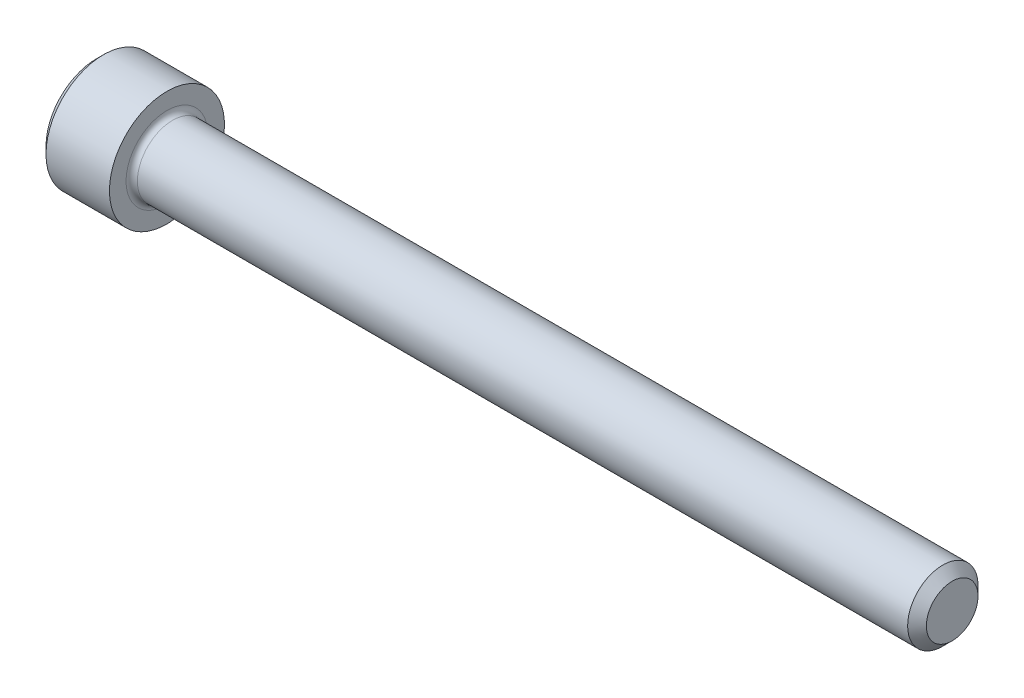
ISO-10303-21;
HEADER;
FILE_DESCRIPTION(('STEP AP214'),'2;1');
FILE_NAME('part.step','',(''),(''),'','','');
FILE_SCHEMA(('AUTOMOTIVE_DESIGN { 1 0 10303 214 1 1 1 1 }'));
ENDSEC;
DATA;
#1=APPLICATION_CONTEXT('core data for automotive mechanical design processes');
#2=APPLICATION_PROTOCOL_DEFINITION('international standard','automotive_design',2000,#1);
#3=PRODUCT_CONTEXT('',#1,'mechanical');
#4=PRODUCT('Part','Part','',(#3));
#5=PRODUCT_RELATED_PRODUCT_CATEGORY('part','',(#4));
#6=PRODUCT_DEFINITION_FORMATION('','',#4);
#7=PRODUCT_DEFINITION_CONTEXT('part definition',#1,'design');
#8=PRODUCT_DEFINITION('design','',#6,#7);
#9=PRODUCT_DEFINITION_SHAPE('','',#8);
#10=(LENGTH_UNIT() NAMED_UNIT(*) SI_UNIT(.MILLI.,.METRE.));
#11=(NAMED_UNIT(*) PLANE_ANGLE_UNIT() SI_UNIT($,.RADIAN.));
#12=(NAMED_UNIT(*) SI_UNIT($,.STERADIAN.) SOLID_ANGLE_UNIT());
#13=UNCERTAINTY_MEASURE_WITH_UNIT(LENGTH_MEASURE(1.E-05),#10,'distance_accuracy_value','');
#14=(GEOMETRIC_REPRESENTATION_CONTEXT(3) GLOBAL_UNCERTAINTY_ASSIGNED_CONTEXT((#13)) GLOBAL_UNIT_ASSIGNED_CONTEXT((#10,
#11,#12)) REPRESENTATION_CONTEXT('',''));
#15=CARTESIAN_POINT('',(0.,0.,0.));
#16=DIRECTION('',(0.,0.,1.));
#17=DIRECTION('',(1.,0.,0.));
#18=AXIS2_PLACEMENT_3D('',#15,#16,#17);
#19=CARTESIAN_POINT('',(0.,0.,0.));
#20=DIRECTION('',(-1.,0.,0.));
#21=DIRECTION('',(0.,0.,1.));
#22=AXIS2_PLACEMENT_3D('',#19,#20,#21);
#23=PLANE('',#22);
#24=DIRECTION('',(0.,-0.499999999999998,0.86602540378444));
#25=VECTOR('',#24,1.);
#26=CARTESIAN_POINT('',(0.,1.37848150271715,0.));
#27=LINE('',#26,#25);
#28=CARTESIAN_POINT('',(0.,1.37848150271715,0.));
#29=VERTEX_POINT('',#28);
#30=CARTESIAN_POINT('',(0.,0.689240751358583,1.1938));
#31=VERTEX_POINT('',#30);
#32=EDGE_CURVE('E258',#29,#31,#27,.T.);
#33=ORIENTED_EDGE('',*,*,#32,.T.);
#34=DIRECTION('',(0.,1.,0.));
#35=VECTOR('',#34,1.);
#36=CARTESIAN_POINT('',(0.,-0.689240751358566,1.1938));
#37=LINE('',#36,#35);
#38=CARTESIAN_POINT('',(0.,-0.689240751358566,1.1938));
#39=VERTEX_POINT('',#38);
#40=EDGE_CURVE('E129',#39,#31,#37,.T.);
#41=ORIENTED_EDGE('',*,*,#40,.F.);
#42=DIRECTION('',(0.,-0.500000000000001,-0.866025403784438));
#43=VECTOR('',#42,1.);
#44=CARTESIAN_POINT('',(0.,-0.689240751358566,1.1938));
#45=LINE('',#44,#43);
#46=CARTESIAN_POINT('',(0.,-1.37848150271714,0.));
#47=VERTEX_POINT('',#46);
#48=EDGE_CURVE('E261',#39,#47,#45,.T.);
#49=ORIENTED_EDGE('',*,*,#48,.T.);
#50=DIRECTION('',(0.,0.499999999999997,-0.86602540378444));
#51=VECTOR('',#50,1.);
#52=CARTESIAN_POINT('',(0.,-1.37848150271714,0.));
#53=LINE('',#52,#51);
#54=CARTESIAN_POINT('',(0.,-0.689240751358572,-1.1938));
#55=VERTEX_POINT('',#54);
#56=EDGE_CURVE('E264',#47,#55,#53,.T.);
#57=ORIENTED_EDGE('',*,*,#56,.T.);
#58=DIRECTION('',(0.,-1.,0.));
#59=VECTOR('',#58,1.);
#60=CARTESIAN_POINT('',(0.,0.689240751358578,-1.1938));
#61=LINE('',#60,#59);
#62=CARTESIAN_POINT('',(0.,0.689240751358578,-1.1938));
#63=VERTEX_POINT('',#62);
#64=EDGE_CURVE('E267',#63,#55,#61,.T.);
#65=ORIENTED_EDGE('',*,*,#64,.F.);
#66=DIRECTION('',(0.,-0.500000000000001,-0.866025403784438));
#67=VECTOR('',#66,1.);
#68=CARTESIAN_POINT('',(0.,1.37848150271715,0.));
#69=LINE('',#68,#67);
#70=EDGE_CURVE('E124',#29,#63,#69,.T.);
#71=ORIENTED_EDGE('',*,*,#70,.F.);
#72=EDGE_LOOP('',(#33,#41,#49,#57,#65,#71));
#73=FACE_BOUND('',#72,.T.);
#74=CARTESIAN_POINT('',(0.,0.,0.));
#75=DIRECTION('',(-1.,0.,0.));
#76=DIRECTION('',(0.,0.,1.));
#77=AXIS2_PLACEMENT_3D('',#74,#75,#76);
#78=CIRCLE('',#77,2.0447);
#79=CARTESIAN_POINT('',(0.,0.,2.0447));
#80=VERTEX_POINT('',#79);
#81=EDGE_CURVE('E153',#80,#80,#78,.T.);
#82=ORIENTED_EDGE('',*,*,#81,.T.);
#83=EDGE_LOOP('',(#82));
#84=FACE_BOUND('',#83,.T.);
#85=ADVANCED_FACE('F33',(#73,#84),#23,.T.);
#86=CARTESIAN_POINT('',(0.,0.,0.));
#87=DIRECTION('',(1.,0.,0.));
#88=DIRECTION('',(0.,0.,-1.));
#89=AXIS2_PLACEMENT_3D('',#86,#87,#88);
#90=CONICAL_SURFACE('',#89,2.0447,0.785398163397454);
#91=CARTESIAN_POINT('',(0.279399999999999,0.,0.));
#92=DIRECTION('',(-1.,0.,0.));
#93=DIRECTION('',(0.,0.,1.));
#94=AXIS2_PLACEMENT_3D('',#91,#92,#93);
#95=CIRCLE('',#94,2.3241);
#96=CARTESIAN_POINT('',(0.279399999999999,0.,2.3241));
#97=VERTEX_POINT('',#96);
#98=EDGE_CURVE('E150',#97,#97,#95,.T.);
#99=ORIENTED_EDGE('',*,*,#98,.T.);
#100=EDGE_LOOP('',(#99));
#101=FACE_BOUND('',#100,.T.);
#102=ORIENTED_EDGE('',*,*,#81,.F.);
#103=EDGE_LOOP('',(#102));
#104=FACE_BOUND('',#103,.T.);
#105=ADVANCED_FACE('F174',(#101,#104),#90,.T.);
#106=CARTESIAN_POINT('',(-31.75,0.,0.));
#107=DIRECTION('',(-1.,0.,0.));
#108=DIRECTION('',(0.,0.,1.));
#109=AXIS2_PLACEMENT_3D('',#106,#107,#108);
#110=CYLINDRICAL_SURFACE('',#109,2.3241);
#111=CARTESIAN_POINT('',(2.8448,0.,0.));
#112=DIRECTION('',(-1.,0.,0.));
#113=DIRECTION('',(0.,0.,1.));
#114=AXIS2_PLACEMENT_3D('',#111,#112,#113);
#115=CIRCLE('',#114,2.3241);
#116=CARTESIAN_POINT('',(2.8448,0.,2.3241));
#117=VERTEX_POINT('',#116);
#118=EDGE_CURVE('E147',#117,#117,#115,.T.);
#119=ORIENTED_EDGE('',*,*,#118,.T.);
#120=EDGE_LOOP('',(#119));
#121=FACE_BOUND('',#120,.T.);
#122=ORIENTED_EDGE('',*,*,#98,.F.);
#123=EDGE_LOOP('',(#122));
#124=FACE_BOUND('',#123,.T.);
#125=ADVANCED_FACE('F179',(#121,#124),#110,.T.);
#126=CARTESIAN_POINT('',(2.8448,2.3241,0.));
#127=DIRECTION('',(1.,0.,0.));
#128=DIRECTION('',(0.,0.,-1.));
#129=AXIS2_PLACEMENT_3D('',#126,#127,#128);
#130=PLANE('',#129);
#131=CARTESIAN_POINT('',(2.8448,0.,0.));
#132=DIRECTION('',(1.,0.,0.));
#133=DIRECTION('',(0.,0.,-1.));
#134=AXIS2_PLACEMENT_3D('',#131,#132,#133);
#135=CIRCLE('',#134,1.65099999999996);
#136=CARTESIAN_POINT('',(2.8448,0.,-1.65099999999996));
#137=VERTEX_POINT('',#136);
#138=EDGE_CURVE('E41',#137,#137,#135,.F.);
#139=ORIENTED_EDGE('',*,*,#138,.T.);
#140=EDGE_LOOP('',(#139));
#141=FACE_BOUND('',#140,.T.);
#142=ORIENTED_EDGE('',*,*,#118,.F.);
#143=EDGE_LOOP('',(#142));
#144=FACE_BOUND('',#143,.T.);
#145=ADVANCED_FACE('F158',(#141,#144),#130,.T.);
#146=CARTESIAN_POINT('',(-31.75,0.,0.));
#147=DIRECTION('',(-1.,0.,0.));
#148=DIRECTION('',(0.,0.,1.));
#149=AXIS2_PLACEMENT_3D('',#146,#147,#148);
#150=CYLINDRICAL_SURFACE('',#149,1.42239999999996);
#151=CARTESIAN_POINT('',(3.0734,0.,0.));
#152=DIRECTION('',(1.,0.,0.));
#153=DIRECTION('',(0.,0.,-1.));
#154=AXIS2_PLACEMENT_3D('',#151,#152,#153);
#155=CIRCLE('',#154,1.42239999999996);
#156=CARTESIAN_POINT('',(3.0734,0.,-1.42239999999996));
#157=VERTEX_POINT('',#156);
#158=EDGE_CURVE('E11',#157,#157,#155,.T.);
#159=ORIENTED_EDGE('',*,*,#158,.T.);
#160=EDGE_LOOP('',(#159));
#161=FACE_BOUND('',#160,.T.);
#162=CARTESIAN_POINT('',(34.2163399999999,0.,0.));
#163=DIRECTION('',(-1.,0.,0.));
#164=DIRECTION('',(0.,0.,1.));
#165=AXIS2_PLACEMENT_3D('',#162,#163,#164);
#166=CIRCLE('',#165,1.42239999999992);
#167=CARTESIAN_POINT('',(34.2163399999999,0.,1.42239999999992));
#168=VERTEX_POINT('',#167);
#169=EDGE_CURVE('E144',#168,#168,#166,.T.);
#170=ORIENTED_EDGE('',*,*,#169,.T.);
#171=EDGE_LOOP('',(#170));
#172=FACE_BOUND('',#171,.T.);
#173=ADVANCED_FACE('F189',(#161,#172),#150,.T.);
#174=CARTESIAN_POINT('',(34.5948,0.,0.));
#175=DIRECTION('',(-1.,0.,0.));
#176=DIRECTION('',(0.,0.,1.));
#177=AXIS2_PLACEMENT_3D('',#174,#175,#176);
#178=CONICAL_SURFACE('',#177,1.04394,0.785398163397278);
#179=ORIENTED_EDGE('',*,*,#169,.F.);
#180=EDGE_LOOP('',(#179));
#181=FACE_BOUND('',#180,.T.);
#182=CARTESIAN_POINT('',(34.5948,0.,0.));
#183=DIRECTION('',(-1.,0.,0.));
#184=DIRECTION('',(0.,0.,1.));
#185=AXIS2_PLACEMENT_3D('',#182,#183,#184);
#186=CIRCLE('',#185,1.04394);
#187=CARTESIAN_POINT('',(34.5948,0.,1.04394));
#188=VERTEX_POINT('',#187);
#189=EDGE_CURVE('E140',#188,#188,#186,.T.);
#190=ORIENTED_EDGE('',*,*,#189,.T.);
#191=EDGE_LOOP('',(#190));
#192=FACE_BOUND('',#191,.T.);
#193=ADVANCED_FACE('F169',(#181,#192),#178,.T.);
#194=CARTESIAN_POINT('',(34.5948,1.04394,0.));
#195=DIRECTION('',(1.,0.,0.));
#196=DIRECTION('',(0.,0.,-1.));
#197=AXIS2_PLACEMENT_3D('',#194,#195,#196);
#198=PLANE('',#197);
#199=ORIENTED_EDGE('',*,*,#189,.F.);
#200=EDGE_LOOP('',(#199));
#201=FACE_BOUND('',#200,.T.);
#202=ADVANCED_FACE('F162',(#201),#198,.T.);
#203=CARTESIAN_POINT('',(3.0734,0.,0.));
#204=DIRECTION('',(1.,0.,0.));
#205=DIRECTION('',(0.,0.,-1.));
#206=AXIS2_PLACEMENT_3D('',#203,#204,#205);
#207=TOROIDAL_SURFACE('',#206,1.65099999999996,0.2286);
#208=ORIENTED_EDGE('',*,*,#158,.F.);
#209=EDGE_LOOP('',(#208));
#210=FACE_BOUND('',#209,.T.);
#211=ORIENTED_EDGE('',*,*,#138,.F.);
#212=EDGE_LOOP('',(#211));
#213=FACE_BOUND('',#212,.T.);
#214=ADVANCED_FACE('F35',(#210,#213),#207,.F.);
#215=CARTESIAN_POINT('',(1.2954,1.37848150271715,0.));
#216=DIRECTION('',(0.,-0.86602540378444,-0.499999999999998));
#217=DIRECTION('',(0.,0.499999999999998,-0.86602540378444));
#218=AXIS2_PLACEMENT_3D('',#215,#216,#217);
#219=PLANE('',#218);
#220=ORIENTED_EDGE('',*,*,#32,.F.);
#221=DIRECTION('',(-1.,0.,0.));
#222=VECTOR('',#221,1.);
#223=CARTESIAN_POINT('',(1.2954,1.37848150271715,0.));
#224=LINE('',#223,#222);
#225=CARTESIAN_POINT('',(1.2954,1.37848150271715,0.));
#226=VERTEX_POINT('',#225);
#227=EDGE_CURVE('E248',#226,#29,#224,.T.);
#228=ORIENTED_EDGE('',*,*,#227,.F.);
#229=DIRECTION('',(0.,-0.499999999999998,0.86602540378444));
#230=VECTOR('',#229,1.);
#231=CARTESIAN_POINT('',(1.2954,1.37848150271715,0.));
#232=LINE('',#231,#230);
#233=CARTESIAN_POINT('',(1.2954,1.03386112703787,0.596899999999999));
#234=VERTEX_POINT('',#233);
#235=EDGE_CURVE('E116',#226,#234,#232,.T.);
#236=ORIENTED_EDGE('',*,*,#235,.T.);
#237=CARTESIAN_POINT('',(1.2954,0.689240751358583,1.1938));
#238=VERTEX_POINT('',#237);
#239=EDGE_CURVE('E107',#234,#238,#232,.T.);
#240=ORIENTED_EDGE('',*,*,#239,.T.);
#241=DIRECTION('',(-1.,0.,0.));
#242=VECTOR('',#241,1.);
#243=CARTESIAN_POINT('',(1.2954,0.689240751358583,1.1938));
#244=LINE('',#243,#242);
#245=EDGE_CURVE('E121',#238,#31,#244,.T.);
#246=ORIENTED_EDGE('',*,*,#245,.T.);
#247=EDGE_LOOP('',(#220,#228,#236,#240,#246));
#248=FACE_BOUND('',#247,.T.);
#249=ADVANCED_FACE('F120',(#248),#219,.T.);
#250=CARTESIAN_POINT('',(1.2954,-0.689240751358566,1.1938));
#251=DIRECTION('',(0.,0.,1.));
#252=DIRECTION('',(0.,-1.,0.));
#253=AXIS2_PLACEMENT_3D('',#250,#251,#252);
#254=PLANE('',#253);
#255=ORIENTED_EDGE('',*,*,#40,.T.);
#256=ORIENTED_EDGE('',*,*,#245,.F.);
#257=DIRECTION('',(0.,1.,0.));
#258=VECTOR('',#257,1.);
#259=CARTESIAN_POINT('',(1.2954,-0.689240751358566,1.1938));
#260=LINE('',#259,#258);
#261=CARTESIAN_POINT('',(1.2954,0.,1.1938));
#262=VERTEX_POINT('',#261);
#263=EDGE_CURVE('E104',#262,#238,#260,.T.);
#264=ORIENTED_EDGE('',*,*,#263,.F.);
#265=CARTESIAN_POINT('',(1.2954,-0.689240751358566,1.1938));
#266=VERTEX_POINT('',#265);
#267=EDGE_CURVE('E115',#266,#262,#260,.T.);
#268=ORIENTED_EDGE('',*,*,#267,.F.);
#269=DIRECTION('',(-1.,0.,0.));
#270=VECTOR('',#269,1.);
#271=CARTESIAN_POINT('',(1.2954,-0.689240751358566,1.1938));
#272=LINE('',#271,#270);
#273=EDGE_CURVE('E131',#266,#39,#272,.T.);
#274=ORIENTED_EDGE('',*,*,#273,.T.);
#275=EDGE_LOOP('',(#255,#256,#264,#268,#274));
#276=FACE_BOUND('',#275,.T.);
#277=ADVANCED_FACE('F126',(#276),#254,.F.);
#278=CARTESIAN_POINT('',(1.2954,-0.689240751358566,1.1938));
#279=DIRECTION('',(0.,0.866025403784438,-0.500000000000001));
#280=DIRECTION('',(0.,0.500000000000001,0.866025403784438));
#281=AXIS2_PLACEMENT_3D('',#278,#279,#280);
#282=PLANE('',#281);
#283=ORIENTED_EDGE('',*,*,#48,.F.);
#284=ORIENTED_EDGE('',*,*,#273,.F.);
#285=DIRECTION('',(0.,-0.500000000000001,-0.866025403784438));
#286=VECTOR('',#285,1.);
#287=CARTESIAN_POINT('',(1.2954,-0.689240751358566,1.1938));
#288=LINE('',#287,#286);
#289=CARTESIAN_POINT('',(1.2954,-1.03386112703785,0.596899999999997));
#290=VERTEX_POINT('',#289);
#291=EDGE_CURVE('E287',#266,#290,#288,.T.);
#292=ORIENTED_EDGE('',*,*,#291,.T.);
#293=CARTESIAN_POINT('',(1.2954,-1.37848150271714,0.));
#294=VERTEX_POINT('',#293);
#295=EDGE_CURVE('E276',#290,#294,#288,.T.);
#296=ORIENTED_EDGE('',*,*,#295,.T.);
#297=DIRECTION('',(-1.,0.,0.));
#298=VECTOR('',#297,1.);
#299=CARTESIAN_POINT('',(1.2954,-1.37848150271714,0.));
#300=LINE('',#299,#298);
#301=EDGE_CURVE('E136',#294,#47,#300,.T.);
#302=ORIENTED_EDGE('',*,*,#301,.T.);
#303=EDGE_LOOP('',(#283,#284,#292,#296,#302));
#304=FACE_BOUND('',#303,.T.);
#305=ADVANCED_FACE('F202',(#304),#282,.T.);
#306=CARTESIAN_POINT('',(1.2954,-1.37848150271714,0.));
#307=DIRECTION('',(0.,0.86602540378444,0.499999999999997));
#308=DIRECTION('',(0.,-0.499999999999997,0.86602540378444));
#309=AXIS2_PLACEMENT_3D('',#306,#307,#308);
#310=PLANE('',#309);
#311=ORIENTED_EDGE('',*,*,#56,.F.);
#312=ORIENTED_EDGE('',*,*,#301,.F.);
#313=DIRECTION('',(0.,0.499999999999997,-0.86602540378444));
#314=VECTOR('',#313,1.);
#315=CARTESIAN_POINT('',(1.2954,-1.37848150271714,0.));
#316=LINE('',#315,#314);
#317=CARTESIAN_POINT('',(1.2954,-1.03386112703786,-0.596899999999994));
#318=VERTEX_POINT('',#317);
#319=EDGE_CURVE('E254',#294,#318,#316,.T.);
#320=ORIENTED_EDGE('',*,*,#319,.T.);
#321=CARTESIAN_POINT('',(1.2954,-0.689240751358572,-1.1938));
#322=VERTEX_POINT('',#321);
#323=EDGE_CURVE('E286',#318,#322,#316,.T.);
#324=ORIENTED_EDGE('',*,*,#323,.T.);
#325=DIRECTION('',(-1.,0.,0.));
#326=VECTOR('',#325,1.);
#327=CARTESIAN_POINT('',(1.2954,-0.689240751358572,-1.1938));
#328=LINE('',#327,#326);
#329=EDGE_CURVE('E247',#322,#55,#328,.T.);
#330=ORIENTED_EDGE('',*,*,#329,.T.);
#331=EDGE_LOOP('',(#311,#312,#320,#324,#330));
#332=FACE_BOUND('',#331,.T.);
#333=ADVANCED_FACE('F205',(#332),#310,.T.);
#334=CARTESIAN_POINT('',(1.2954,0.689240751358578,-1.1938));
#335=DIRECTION('',(0.,0.,-1.));
#336=DIRECTION('',(0.,1.,0.));
#337=AXIS2_PLACEMENT_3D('',#334,#335,#336);
#338=PLANE('',#337);
#339=ORIENTED_EDGE('',*,*,#64,.T.);
#340=ORIENTED_EDGE('',*,*,#329,.F.);
#341=DIRECTION('',(0.,-1.,0.));
#342=VECTOR('',#341,1.);
#343=CARTESIAN_POINT('',(1.2954,0.689240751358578,-1.1938));
#344=LINE('',#343,#342);
#345=CARTESIAN_POINT('',(1.2954,0.,-1.1938));
#346=VERTEX_POINT('',#345);
#347=EDGE_CURVE('E251',#346,#322,#344,.T.);
#348=ORIENTED_EDGE('',*,*,#347,.F.);
#349=CARTESIAN_POINT('',(1.2954,0.689240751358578,-1.1938));
#350=VERTEX_POINT('',#349);
#351=EDGE_CURVE('E48',#350,#346,#344,.T.);
#352=ORIENTED_EDGE('',*,*,#351,.F.);
#353=DIRECTION('',(-1.,0.,0.));
#354=VECTOR('',#353,1.);
#355=CARTESIAN_POINT('',(1.2954,0.689240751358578,-1.1938));
#356=LINE('',#355,#354);
#357=EDGE_CURVE('E244',#350,#63,#356,.T.);
#358=ORIENTED_EDGE('',*,*,#357,.T.);
#359=EDGE_LOOP('',(#339,#340,#348,#352,#358));
#360=FACE_BOUND('',#359,.T.);
#361=ADVANCED_FACE('F209',(#360),#338,.F.);
#362=CARTESIAN_POINT('',(1.2954,1.37848150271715,0.));
#363=DIRECTION('',(0.,0.866025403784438,-0.500000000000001));
#364=DIRECTION('',(0.,0.500000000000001,0.866025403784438));
#365=AXIS2_PLACEMENT_3D('',#362,#363,#364);
#366=PLANE('',#365);
#367=ORIENTED_EDGE('',*,*,#70,.T.);
#368=ORIENTED_EDGE('',*,*,#357,.F.);
#369=DIRECTION('',(0.,-0.500000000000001,-0.866025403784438));
#370=VECTOR('',#369,1.);
#371=CARTESIAN_POINT('',(1.2954,1.37848150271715,0.));
#372=LINE('',#371,#370);
#373=CARTESIAN_POINT('',(1.2954,1.03386112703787,-0.596900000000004));
#374=VERTEX_POINT('',#373);
#375=EDGE_CURVE('E234',#374,#350,#372,.T.);
#376=ORIENTED_EDGE('',*,*,#375,.F.);
#377=EDGE_CURVE('E240',#226,#374,#372,.T.);
#378=ORIENTED_EDGE('',*,*,#377,.F.);
#379=ORIENTED_EDGE('',*,*,#227,.T.);
#380=EDGE_LOOP('',(#367,#368,#376,#378,#379));
#381=FACE_BOUND('',#380,.T.);
#382=ADVANCED_FACE('F213',(#381),#366,.F.);
#383=CARTESIAN_POINT('',(1.2954,2.06772225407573,-1.1938));
#384=DIRECTION('',(1.,0.,0.));
#385=DIRECTION('',(0.,0.,-1.));
#386=AXIS2_PLACEMENT_3D('',#383,#384,#385);
#387=PLANE('',#386);
#388=ORIENTED_EDGE('',*,*,#347,.T.);
#389=ORIENTED_EDGE('',*,*,#323,.F.);
#390=CARTESIAN_POINT('',(1.2954,0.,0.));
#391=DIRECTION('',(-1.,0.,0.));
#392=DIRECTION('',(0.,0.,1.));
#393=AXIS2_PLACEMENT_3D('',#390,#391,#392);
#394=CIRCLE('',#393,1.1938);
#395=EDGE_CURVE('E282',#346,#318,#394,.T.);
#396=ORIENTED_EDGE('',*,*,#395,.F.);
#397=EDGE_LOOP('',(#388,#389,#396));
#398=FACE_BOUND('',#397,.T.);
#399=ADVANCED_FACE('F217',(#398),#387,.F.);
#400=ORIENTED_EDGE('',*,*,#319,.F.);
#401=ORIENTED_EDGE('',*,*,#295,.F.);
#402=EDGE_CURVE('E134',#318,#290,#394,.T.);
#403=ORIENTED_EDGE('',*,*,#402,.F.);
#404=EDGE_LOOP('',(#400,#401,#403));
#405=FACE_BOUND('',#404,.T.);
#406=ADVANCED_FACE('F220',(#405),#387,.F.);
#407=ORIENTED_EDGE('',*,*,#291,.F.);
#408=ORIENTED_EDGE('',*,*,#267,.T.);
#409=EDGE_CURVE('E130',#290,#262,#394,.T.);
#410=ORIENTED_EDGE('',*,*,#409,.F.);
#411=EDGE_LOOP('',(#407,#408,#410));
#412=FACE_BOUND('',#411,.T.);
#413=ADVANCED_FACE('F225',(#412),#387,.F.);
#414=ORIENTED_EDGE('',*,*,#263,.T.);
#415=ORIENTED_EDGE('',*,*,#239,.F.);
#416=EDGE_CURVE('E110',#262,#234,#394,.T.);
#417=ORIENTED_EDGE('',*,*,#416,.F.);
#418=EDGE_LOOP('',(#414,#415,#417));
#419=FACE_BOUND('',#418,.T.);
#420=ADVANCED_FACE('F106',(#419),#387,.F.);
#421=ORIENTED_EDGE('',*,*,#235,.F.);
#422=ORIENTED_EDGE('',*,*,#377,.T.);
#423=EDGE_CURVE('E141',#234,#374,#394,.T.);
#424=ORIENTED_EDGE('',*,*,#423,.F.);
#425=EDGE_LOOP('',(#421,#422,#424));
#426=FACE_BOUND('',#425,.T.);
#427=ADVANCED_FACE('F228',(#426),#387,.F.);
#428=ORIENTED_EDGE('',*,*,#375,.T.);
#429=ORIENTED_EDGE('',*,*,#351,.T.);
#430=EDGE_CURVE('E237',#374,#346,#394,.T.);
#431=ORIENTED_EDGE('',*,*,#430,.F.);
#432=EDGE_LOOP('',(#428,#429,#431));
#433=FACE_BOUND('',#432,.T.);
#434=ADVANCED_FACE('F198',(#433),#387,.F.);
#435=CARTESIAN_POINT('',(1.2954,0.,0.));
#436=DIRECTION('',(-1.,0.,0.));
#437=DIRECTION('',(0.,0.,1.));
#438=AXIS2_PLACEMENT_3D('',#435,#436,#437);
#439=CONICAL_SURFACE('',#438,1.1938,1.04719755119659);
#440=CARTESIAN_POINT('',(1.98464075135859,0.,0.));
#441=VERTEX_POINT('',#440);
#442=VERTEX_LOOP('',#441);
#443=FACE_BOUND('',#442,.T.);
#444=ORIENTED_EDGE('',*,*,#416,.T.);
#445=ORIENTED_EDGE('',*,*,#423,.T.);
#446=ORIENTED_EDGE('',*,*,#430,.T.);
#447=ORIENTED_EDGE('',*,*,#395,.T.);
#448=ORIENTED_EDGE('',*,*,#402,.T.);
#449=ORIENTED_EDGE('',*,*,#409,.T.);
#450=EDGE_LOOP('',(#444,#445,#446,#447,#448,#449));
#451=FACE_BOUND('',#450,.T.);
#452=ADVANCED_FACE('F196',(#443,#451),#439,.F.);
#453=CLOSED_SHELL('',(#85,#105,#125,#145,#173,#193,#202,#214,#249,#277,#305,#333,#361,#382,#399,
#406,#413,#420,#427,#434,#452));
#454=MANIFOLD_SOLID_BREP('B2',#453);
#455=ADVANCED_BREP_SHAPE_REPRESENTATION('',(#18,#454),#14);
#456=SHAPE_DEFINITION_REPRESENTATION(#9,#455);
ENDSEC;
END-ISO-10303-21;
